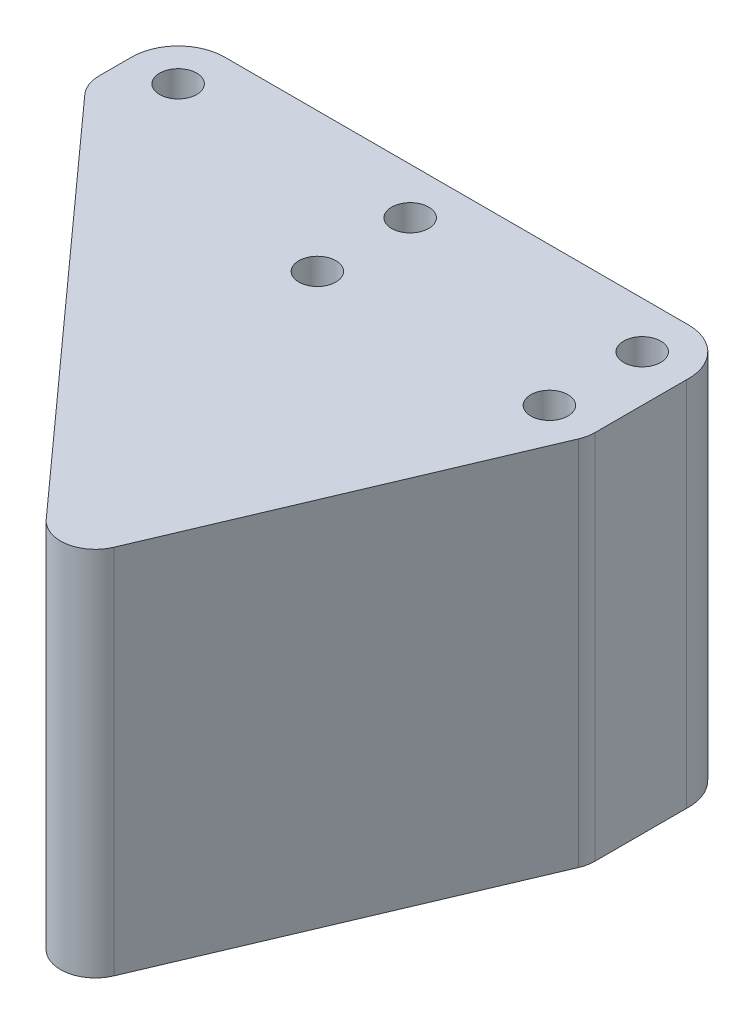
ISO-10303-21;
HEADER;
FILE_DESCRIPTION(('STEP AP214'),'2;1');
FILE_NAME('part.step','',(''),(''),'','','');
FILE_SCHEMA(('AUTOMOTIVE_DESIGN { 1 0 10303 214 1 1 1 1 }'));
ENDSEC;
DATA;
#1=APPLICATION_CONTEXT('core data for automotive mechanical design processes');
#2=APPLICATION_PROTOCOL_DEFINITION('international standard','automotive_design',2000,#1);
#3=PRODUCT_CONTEXT('',#1,'mechanical');
#4=PRODUCT('Part','Part','',(#3));
#5=PRODUCT_RELATED_PRODUCT_CATEGORY('part','',(#4));
#6=PRODUCT_DEFINITION_FORMATION('','',#4);
#7=PRODUCT_DEFINITION_CONTEXT('part definition',#1,'design');
#8=PRODUCT_DEFINITION('design','',#6,#7);
#9=PRODUCT_DEFINITION_SHAPE('','',#8);
#10=(LENGTH_UNIT() NAMED_UNIT(*) SI_UNIT(.MILLI.,.METRE.));
#11=(NAMED_UNIT(*) PLANE_ANGLE_UNIT() SI_UNIT($,.RADIAN.));
#12=(NAMED_UNIT(*) SI_UNIT($,.STERADIAN.) SOLID_ANGLE_UNIT());
#13=UNCERTAINTY_MEASURE_WITH_UNIT(LENGTH_MEASURE(1.E-05),#10,'distance_accuracy_value','');
#14=(GEOMETRIC_REPRESENTATION_CONTEXT(3) GLOBAL_UNCERTAINTY_ASSIGNED_CONTEXT((#13)) GLOBAL_UNIT_ASSIGNED_CONTEXT((#10,
#11,#12)) REPRESENTATION_CONTEXT('',''));
#15=CARTESIAN_POINT('',(0.,0.,0.));
#16=DIRECTION('',(0.,0.,1.));
#17=DIRECTION('',(1.,0.,0.));
#18=AXIS2_PLACEMENT_3D('',#15,#16,#17);
#19=CARTESIAN_POINT('',(-140.,4.,-8.00000000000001));
#20=DIRECTION('',(0.,0.,1.));
#21=DIRECTION('',(1.,0.,0.));
#22=AXIS2_PLACEMENT_3D('',#19,#20,#21);
#23=PLANE('',#22);
#24=DIRECTION('',(0.,-1.,0.));
#25=VECTOR('',#24,1.);
#26=CARTESIAN_POINT('',(-15.,36.,-8.));
#27=LINE('',#26,#25);
#28=CARTESIAN_POINT('',(-15.,36.,-8.));
#29=VERTEX_POINT('',#28);
#30=CARTESIAN_POINT('',(-15.,4.,-8.));
#31=VERTEX_POINT('',#30);
#32=EDGE_CURVE('E144',#29,#31,#27,.T.);
#33=ORIENTED_EDGE('',*,*,#32,.T.);
#34=DIRECTION('',(-1.,0.,0.));
#35=VECTOR('',#34,1.);
#36=CARTESIAN_POINT('',(-140.,4.,-8.00000000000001));
#37=LINE('',#36,#35);
#38=CARTESIAN_POINT('',(-55.,4.,-8.));
#39=VERTEX_POINT('',#38);
#40=EDGE_CURVE('E135',#31,#39,#37,.T.);
#41=ORIENTED_EDGE('',*,*,#40,.T.);
#42=DIRECTION('',(0.,-1.,0.));
#43=VECTOR('',#42,1.);
#44=CARTESIAN_POINT('',(-55.,36.,-8.));
#45=LINE('',#44,#43);
#46=CARTESIAN_POINT('',(-55.,36.,-8.));
#47=VERTEX_POINT('',#46);
#48=EDGE_CURVE('E149',#47,#39,#45,.T.);
#49=ORIENTED_EDGE('',*,*,#48,.F.);
#50=DIRECTION('',(-1.,0.,0.));
#51=VECTOR('',#50,1.);
#52=CARTESIAN_POINT('',(-55.,36.,-8.));
#53=LINE('',#52,#51);
#54=EDGE_CURVE('E202',#29,#47,#53,.T.);
#55=ORIENTED_EDGE('',*,*,#54,.F.);
#56=EDGE_LOOP('',(#33,#41,#49,#55));
#57=FACE_BOUND('',#56,.T.);
#58=ADVANCED_FACE('F41',(#57),#23,.F.);
#59=CARTESIAN_POINT('',(-15.,0.,-4.));
#60=DIRECTION('',(0.,1.,0.));
#61=DIRECTION('',(0.,0.,1.));
#62=AXIS2_PLACEMENT_3D('',#59,#60,#61);
#63=CYLINDRICAL_SURFACE('',#62,1.60000000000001);
#64=CARTESIAN_POINT('',(-15.,4.,-4.));
#65=DIRECTION('',(0.,1.,0.));
#66=DIRECTION('',(0.,0.,1.));
#67=AXIS2_PLACEMENT_3D('',#64,#65,#66);
#68=CIRCLE('',#67,1.60000000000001);
#69=CARTESIAN_POINT('',(-15.,4.,-2.4));
#70=VERTEX_POINT('',#69);
#71=EDGE_CURVE('E299',#70,#70,#68,.F.);
#72=ORIENTED_EDGE('',*,*,#71,.T.);
#73=EDGE_LOOP('',(#72));
#74=FACE_BOUND('',#73,.T.);
#75=CARTESIAN_POINT('',(-15.,36.,-4.));
#76=DIRECTION('',(0.,1.,0.));
#77=DIRECTION('',(0.,0.,1.));
#78=AXIS2_PLACEMENT_3D('',#75,#76,#77);
#79=CIRCLE('',#78,1.60000000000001);
#80=CARTESIAN_POINT('',(-15.,36.,-2.4));
#81=VERTEX_POINT('',#80);
#82=EDGE_CURVE('E292',#81,#81,#79,.T.);
#83=ORIENTED_EDGE('',*,*,#82,.T.);
#84=EDGE_LOOP('',(#83));
#85=FACE_BOUND('',#84,.T.);
#86=ADVANCED_FACE('F236',(#74,#85),#63,.F.);
#87=CARTESIAN_POINT('',(-35.,0.,-3.99999999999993));
#88=DIRECTION('',(0.,1.,0.));
#89=DIRECTION('',(0.,0.,1.));
#90=AXIS2_PLACEMENT_3D('',#87,#88,#89);
#91=CYLINDRICAL_SURFACE('',#90,1.60000000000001);
#92=CARTESIAN_POINT('',(-35.,4.,-3.99999999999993));
#93=DIRECTION('',(0.,1.,0.));
#94=DIRECTION('',(0.,0.,1.));
#95=AXIS2_PLACEMENT_3D('',#92,#93,#94);
#96=CIRCLE('',#95,1.60000000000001);
#97=CARTESIAN_POINT('',(-35.,4.,-2.39999999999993));
#98=VERTEX_POINT('',#97);
#99=EDGE_CURVE('E302',#98,#98,#96,.F.);
#100=ORIENTED_EDGE('',*,*,#99,.T.);
#101=EDGE_LOOP('',(#100));
#102=FACE_BOUND('',#101,.T.);
#103=CARTESIAN_POINT('',(-35.,36.,-3.99999999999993));
#104=DIRECTION('',(0.,1.,0.));
#105=DIRECTION('',(0.,0.,1.));
#106=AXIS2_PLACEMENT_3D('',#103,#104,#105);
#107=CIRCLE('',#106,1.60000000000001);
#108=CARTESIAN_POINT('',(-35.,36.,-2.39999999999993));
#109=VERTEX_POINT('',#108);
#110=EDGE_CURVE('E216',#109,#109,#107,.T.);
#111=ORIENTED_EDGE('',*,*,#110,.T.);
#112=EDGE_LOOP('',(#111));
#113=FACE_BOUND('',#112,.T.);
#114=ADVANCED_FACE('F242',(#102,#113),#91,.F.);
#115=CARTESIAN_POINT('',(-55.,0.,-3.99999999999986));
#116=DIRECTION('',(0.,1.,0.));
#117=DIRECTION('',(0.,0.,1.));
#118=AXIS2_PLACEMENT_3D('',#115,#116,#117);
#119=CYLINDRICAL_SURFACE('',#118,1.59999999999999);
#120=CARTESIAN_POINT('',(-55.,4.,-3.99999999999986));
#121=DIRECTION('',(0.,1.,0.));
#122=DIRECTION('',(0.,0.,1.));
#123=AXIS2_PLACEMENT_3D('',#120,#121,#122);
#124=CIRCLE('',#123,1.59999999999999);
#125=CARTESIAN_POINT('',(-55.,4.,-2.39999999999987));
#126=VERTEX_POINT('',#125);
#127=EDGE_CURVE('E305',#126,#126,#124,.F.);
#128=ORIENTED_EDGE('',*,*,#127,.T.);
#129=EDGE_LOOP('',(#128));
#130=FACE_BOUND('',#129,.T.);
#131=CARTESIAN_POINT('',(-55.,36.,-3.99999999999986));
#132=DIRECTION('',(0.,1.,0.));
#133=DIRECTION('',(0.,0.,1.));
#134=AXIS2_PLACEMENT_3D('',#131,#132,#133);
#135=CIRCLE('',#134,1.59999999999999);
#136=CARTESIAN_POINT('',(-55.,36.,-2.39999999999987));
#137=VERTEX_POINT('',#136);
#138=EDGE_CURVE('E213',#137,#137,#135,.T.);
#139=ORIENTED_EDGE('',*,*,#138,.T.);
#140=EDGE_LOOP('',(#139));
#141=FACE_BOUND('',#140,.T.);
#142=ADVANCED_FACE('F272',(#130,#141),#119,.F.);
#143=CARTESIAN_POINT('',(-35.,0.,4.));
#144=DIRECTION('',(0.,1.,0.));
#145=DIRECTION('',(0.,0.,1.));
#146=AXIS2_PLACEMENT_3D('',#143,#144,#145);
#147=CYLINDRICAL_SURFACE('',#146,1.60000000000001);
#148=CARTESIAN_POINT('',(-35.,4.,4.));
#149=DIRECTION('',(0.,1.,0.));
#150=DIRECTION('',(0.,0.,1.));
#151=AXIS2_PLACEMENT_3D('',#148,#149,#150);
#152=CIRCLE('',#151,1.60000000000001);
#153=CARTESIAN_POINT('',(-35.,4.,5.60000000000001));
#154=VERTEX_POINT('',#153);
#155=EDGE_CURVE('E288',#154,#154,#152,.F.);
#156=ORIENTED_EDGE('',*,*,#155,.T.);
#157=EDGE_LOOP('',(#156));
#158=FACE_BOUND('',#157,.T.);
#159=CARTESIAN_POINT('',(-35.,36.,4.));
#160=DIRECTION('',(0.,1.,0.));
#161=DIRECTION('',(0.,0.,1.));
#162=AXIS2_PLACEMENT_3D('',#159,#160,#161);
#163=CIRCLE('',#162,1.60000000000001);
#164=CARTESIAN_POINT('',(-35.,36.,5.60000000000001));
#165=VERTEX_POINT('',#164);
#166=EDGE_CURVE('E221',#165,#165,#163,.T.);
#167=ORIENTED_EDGE('',*,*,#166,.T.);
#168=EDGE_LOOP('',(#167));
#169=FACE_BOUND('',#168,.T.);
#170=ADVANCED_FACE('F275',(#158,#169),#147,.F.);
#171=CARTESIAN_POINT('',(-14.9999999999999,0.,4.));
#172=DIRECTION('',(0.,1.,0.));
#173=DIRECTION('',(0.,0.,1.));
#174=AXIS2_PLACEMENT_3D('',#171,#172,#173);
#175=CYLINDRICAL_SURFACE('',#174,1.60000000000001);
#176=CARTESIAN_POINT('',(-14.9999999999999,4.,4.));
#177=DIRECTION('',(0.,1.,0.));
#178=DIRECTION('',(0.,0.,1.));
#179=AXIS2_PLACEMENT_3D('',#176,#177,#178);
#180=CIRCLE('',#179,1.60000000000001);
#181=CARTESIAN_POINT('',(-14.9999999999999,4.,5.60000000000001));
#182=VERTEX_POINT('',#181);
#183=EDGE_CURVE('E309',#182,#182,#180,.F.);
#184=ORIENTED_EDGE('',*,*,#183,.T.);
#185=EDGE_LOOP('',(#184));
#186=FACE_BOUND('',#185,.T.);
#187=CARTESIAN_POINT('',(-14.9999999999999,36.,4.));
#188=DIRECTION('',(0.,1.,0.));
#189=DIRECTION('',(0.,0.,1.));
#190=AXIS2_PLACEMENT_3D('',#187,#188,#189);
#191=CIRCLE('',#190,1.60000000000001);
#192=CARTESIAN_POINT('',(-14.9999999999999,36.,5.60000000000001));
#193=VERTEX_POINT('',#192);
#194=EDGE_CURVE('E294',#193,#193,#191,.T.);
#195=ORIENTED_EDGE('',*,*,#194,.T.);
#196=EDGE_LOOP('',(#195));
#197=FACE_BOUND('',#196,.T.);
#198=ADVANCED_FACE('F247',(#186,#197),#175,.F.);
#199=CARTESIAN_POINT('',(-55.,4.,-3.99999999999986));
#200=DIRECTION('',(0.,-1.,0.));
#201=DIRECTION('',(0.,0.,-1.));
#202=AXIS2_PLACEMENT_3D('',#199,#200,#201);
#203=PLANE('',#202);
#204=DIRECTION('',(0.390731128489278,0.,-0.920504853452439));
#205=VECTOR('',#204,1.);
#206=CARTESIAN_POINT('',(-11.0035252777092,4.,4.68045233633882));
#207=LINE('',#206,#205);
#208=CARTESIAN_POINT('',(-23.1798650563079,4.,33.366111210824));
#209=VERTEX_POINT('',#208);
#210=CARTESIAN_POINT('',(-11.2420107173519,4.,5.24228882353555));
#211=VERTEX_POINT('',#210);
#212=EDGE_CURVE('E156',#209,#211,#207,.T.);
#213=ORIENTED_EDGE('',*,*,#212,.F.);
#214=CARTESIAN_POINT('',(-25.9413796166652,4.,32.1939178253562));
#215=DIRECTION('',(0.,-1.,0.));
#216=DIRECTION('',(0.,0.,-1.));
#217=AXIS2_PLACEMENT_3D('',#214,#215,#216);
#218=CIRCLE('',#217,3.);
#219=CARTESIAN_POINT('',(-28.1708140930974,4.,34.2013096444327));
#220=VERTEX_POINT('',#219);
#221=EDGE_CURVE('E163',#209,#220,#218,.T.);
#222=ORIENTED_EDGE('',*,*,#221,.T.);
#223=DIRECTION('',(0.669130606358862,0.,0.743144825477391));
#224=VECTOR('',#223,1.);
#225=CARTESIAN_POINT('',(-25.0198401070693,4.,37.7008207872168));
#226=LINE('',#225,#224);
#227=CARTESIAN_POINT('',(-58.2294344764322,4.,0.817829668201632));
#228=VERTEX_POINT('',#227);
#229=EDGE_CURVE('E147',#228,#220,#226,.T.);
#230=ORIENTED_EDGE('',*,*,#229,.F.);
#231=CARTESIAN_POINT('',(-56.,4.,-1.18956215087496));
#232=DIRECTION('',(0.,-1.,0.));
#233=DIRECTION('',(0.,0.,-1.));
#234=AXIS2_PLACEMENT_3D('',#231,#232,#233);
#235=CIRCLE('',#234,3.);
#236=CARTESIAN_POINT('',(-59.,4.,-1.18956215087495));
#237=VERTEX_POINT('',#236);
#238=EDGE_CURVE('E161',#228,#237,#235,.T.);
#239=ORIENTED_EDGE('',*,*,#238,.T.);
#240=DIRECTION('',(0.,0.,1.));
#241=VECTOR('',#240,1.);
#242=CARTESIAN_POINT('',(-59.,4.,-0.0379700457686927));
#243=LINE('',#242,#241);
#244=CARTESIAN_POINT('',(-59.0000000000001,4.,-3.99999999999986));
#245=VERTEX_POINT('',#244);
#246=EDGE_CURVE('E128',#245,#237,#243,.T.);
#247=ORIENTED_EDGE('',*,*,#246,.F.);
#248=CARTESIAN_POINT('',(-55.,4.,-3.99999999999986));
#249=DIRECTION('',(0.,1.,0.));
#250=DIRECTION('',(0.,0.,-1.));
#251=AXIS2_PLACEMENT_3D('',#248,#249,#250);
#252=CIRCLE('',#251,4.00000000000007);
#253=EDGE_CURVE('E212',#39,#245,#252,.T.);
#254=ORIENTED_EDGE('',*,*,#253,.F.);
#255=ORIENTED_EDGE('',*,*,#40,.F.);
#256=CARTESIAN_POINT('',(-15.,4.,-4.));
#257=DIRECTION('',(0.,1.,0.));
#258=DIRECTION('',(0.,0.,-1.));
#259=AXIS2_PLACEMENT_3D('',#256,#257,#258);
#260=CIRCLE('',#259,4.);
#261=CARTESIAN_POINT('',(-11.0035252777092,4.,-3.83210183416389));
#262=VERTEX_POINT('',#261);
#263=EDGE_CURVE('E127',#262,#31,#260,.T.);
#264=ORIENTED_EDGE('',*,*,#263,.F.);
#265=DIRECTION('',(0.,0.,-1.));
#266=VECTOR('',#265,1.);
#267=CARTESIAN_POINT('',(-11.0035252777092,4.,-3.83210183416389));
#268=LINE('',#267,#266);
#269=CARTESIAN_POINT('',(-11.0035252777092,4.,4.07009543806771));
#270=VERTEX_POINT('',#269);
#271=EDGE_CURVE('E119',#270,#262,#268,.T.);
#272=ORIENTED_EDGE('',*,*,#271,.F.);
#273=CARTESIAN_POINT('',(-14.0035252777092,4.,4.07009543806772));
#274=DIRECTION('',(0.,-1.,0.));
#275=DIRECTION('',(0.,0.,-1.));
#276=AXIS2_PLACEMENT_3D('',#273,#274,#275);
#277=CIRCLE('',#276,3.);
#278=EDGE_CURVE('E159',#270,#211,#277,.T.);
#279=ORIENTED_EDGE('',*,*,#278,.T.);
#280=EDGE_LOOP('',(#213,#222,#230,#239,#247,#254,#255,#264,#272,#279));
#281=FACE_BOUND('',#280,.T.);
#282=ORIENTED_EDGE('',*,*,#99,.F.);
#283=EDGE_LOOP('',(#282));
#284=FACE_BOUND('',#283,.T.);
#285=ORIENTED_EDGE('',*,*,#155,.F.);
#286=EDGE_LOOP('',(#285));
#287=FACE_BOUND('',#286,.T.);
#288=ORIENTED_EDGE('',*,*,#183,.F.);
#289=EDGE_LOOP('',(#288));
#290=FACE_BOUND('',#289,.T.);
#291=ORIENTED_EDGE('',*,*,#127,.F.);
#292=EDGE_LOOP('',(#291));
#293=FACE_BOUND('',#292,.T.);
#294=ORIENTED_EDGE('',*,*,#71,.F.);
#295=EDGE_LOOP('',(#294));
#296=FACE_BOUND('',#295,.T.);
#297=ADVANCED_FACE('F132',(#281,#284,#287,#290,#293,#296),#203,.T.);
#298=CARTESIAN_POINT('',(-55.,36.,-3.99999999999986));
#299=DIRECTION('',(0.,-1.,0.));
#300=DIRECTION('',(0.,0.,-1.));
#301=AXIS2_PLACEMENT_3D('',#298,#299,#300);
#302=PLANE('',#301);
#303=DIRECTION('',(0.669130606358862,0.,0.743144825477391));
#304=VECTOR('',#303,1.);
#305=CARTESIAN_POINT('',(-25.0198401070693,36.,37.7008207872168));
#306=LINE('',#305,#304);
#307=CARTESIAN_POINT('',(-58.2294344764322,36.,0.817829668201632));
#308=VERTEX_POINT('',#307);
#309=CARTESIAN_POINT('',(-28.1708140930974,36.,34.2013096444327));
#310=VERTEX_POINT('',#309);
#311=EDGE_CURVE('E181',#308,#310,#306,.T.);
#312=ORIENTED_EDGE('',*,*,#311,.T.);
#313=CARTESIAN_POINT('',(-25.9413796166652,36.,32.1939178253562));
#314=DIRECTION('',(0.,-1.,0.));
#315=DIRECTION('',(0.,0.,-1.));
#316=AXIS2_PLACEMENT_3D('',#313,#314,#315);
#317=CIRCLE('',#316,3.);
#318=CARTESIAN_POINT('',(-23.1798650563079,36.,33.366111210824));
#319=VERTEX_POINT('',#318);
#320=EDGE_CURVE('E173',#310,#319,#317,.F.);
#321=ORIENTED_EDGE('',*,*,#320,.T.);
#322=DIRECTION('',(0.390731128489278,0.,-0.920504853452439));
#323=VECTOR('',#322,1.);
#324=CARTESIAN_POINT('',(-11.0035252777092,36.,4.68045233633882));
#325=LINE('',#324,#323);
#326=CARTESIAN_POINT('',(-11.2420107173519,36.,5.24228882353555));
#327=VERTEX_POINT('',#326);
#328=EDGE_CURVE('E179',#319,#327,#325,.T.);
#329=ORIENTED_EDGE('',*,*,#328,.T.);
#330=CARTESIAN_POINT('',(-14.0035252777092,36.,4.07009543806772));
#331=DIRECTION('',(0.,-1.,0.));
#332=DIRECTION('',(0.,0.,-1.));
#333=AXIS2_PLACEMENT_3D('',#330,#331,#332);
#334=CIRCLE('',#333,3.);
#335=CARTESIAN_POINT('',(-11.0035252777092,36.,4.07009543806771));
#336=VERTEX_POINT('',#335);
#337=EDGE_CURVE('E56',#327,#336,#334,.F.);
#338=ORIENTED_EDGE('',*,*,#337,.T.);
#339=DIRECTION('',(0.,0.,-1.));
#340=VECTOR('',#339,1.);
#341=CARTESIAN_POINT('',(-11.0035252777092,36.,-3.83210183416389));
#342=LINE('',#341,#340);
#343=CARTESIAN_POINT('',(-11.0035252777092,36.,-3.83210183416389));
#344=VERTEX_POINT('',#343);
#345=EDGE_CURVE('E189',#336,#344,#342,.T.);
#346=ORIENTED_EDGE('',*,*,#345,.T.);
#347=CARTESIAN_POINT('',(-15.,36.,-4.));
#348=DIRECTION('',(0.,1.,0.));
#349=DIRECTION('',(0.,0.,-1.));
#350=AXIS2_PLACEMENT_3D('',#347,#348,#349);
#351=CIRCLE('',#350,4.);
#352=EDGE_CURVE('E142',#344,#29,#351,.T.);
#353=ORIENTED_EDGE('',*,*,#352,.T.);
#354=ORIENTED_EDGE('',*,*,#54,.T.);
#355=CARTESIAN_POINT('',(-55.,36.,-3.99999999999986));
#356=DIRECTION('',(0.,1.,0.));
#357=DIRECTION('',(0.,0.,-1.));
#358=AXIS2_PLACEMENT_3D('',#355,#356,#357);
#359=CIRCLE('',#358,4.00000000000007);
#360=CARTESIAN_POINT('',(-59.,36.,-3.99999999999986));
#361=VERTEX_POINT('',#360);
#362=EDGE_CURVE('E139',#47,#361,#359,.T.);
#363=ORIENTED_EDGE('',*,*,#362,.T.);
#364=DIRECTION('',(0.,0.,1.));
#365=VECTOR('',#364,1.);
#366=CARTESIAN_POINT('',(-59.,36.,-0.0379700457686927));
#367=LINE('',#366,#365);
#368=CARTESIAN_POINT('',(-59.,36.,-1.18956215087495));
#369=VERTEX_POINT('',#368);
#370=EDGE_CURVE('E226',#361,#369,#367,.T.);
#371=ORIENTED_EDGE('',*,*,#370,.T.);
#372=CARTESIAN_POINT('',(-56.,36.,-1.18956215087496));
#373=DIRECTION('',(0.,-1.,0.));
#374=DIRECTION('',(0.,0.,-1.));
#375=AXIS2_PLACEMENT_3D('',#372,#373,#374);
#376=CIRCLE('',#375,3.);
#377=EDGE_CURVE('E171',#369,#308,#376,.F.);
#378=ORIENTED_EDGE('',*,*,#377,.T.);
#379=EDGE_LOOP('',(#312,#321,#329,#338,#346,#353,#354,#363,#371,#378));
#380=FACE_BOUND('',#379,.T.);
#381=ORIENTED_EDGE('',*,*,#138,.F.);
#382=EDGE_LOOP('',(#381));
#383=FACE_BOUND('',#382,.T.);
#384=ORIENTED_EDGE('',*,*,#110,.F.);
#385=EDGE_LOOP('',(#384));
#386=FACE_BOUND('',#385,.T.);
#387=ORIENTED_EDGE('',*,*,#166,.F.);
#388=EDGE_LOOP('',(#387));
#389=FACE_BOUND('',#388,.T.);
#390=ORIENTED_EDGE('',*,*,#82,.F.);
#391=EDGE_LOOP('',(#390));
#392=FACE_BOUND('',#391,.T.);
#393=ORIENTED_EDGE('',*,*,#194,.F.);
#394=EDGE_LOOP('',(#393));
#395=FACE_BOUND('',#394,.T.);
#396=ADVANCED_FACE('F177',(#380,#383,#386,#389,#392,#395),#302,.F.);
#397=CARTESIAN_POINT('',(-55.,36.,-3.99999999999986));
#398=DIRECTION('',(0.,-1.,0.));
#399=DIRECTION('',(0.,0.,-1.));
#400=AXIS2_PLACEMENT_3D('',#397,#398,#399);
#401=CYLINDRICAL_SURFACE('',#400,4.00000000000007);
#402=ORIENTED_EDGE('',*,*,#253,.T.);
#403=DIRECTION('',(0.,-1.,0.));
#404=VECTOR('',#403,1.);
#405=CARTESIAN_POINT('',(-59.,36.,-3.99999999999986));
#406=LINE('',#405,#404);
#407=EDGE_CURVE('E143',#361,#245,#406,.T.);
#408=ORIENTED_EDGE('',*,*,#407,.F.);
#409=ORIENTED_EDGE('',*,*,#362,.F.);
#410=ORIENTED_EDGE('',*,*,#48,.T.);
#411=EDGE_LOOP('',(#402,#408,#409,#410));
#412=FACE_BOUND('',#411,.T.);
#413=ADVANCED_FACE('F270',(#412),#401,.T.);
#414=CARTESIAN_POINT('',(-59.,36.,-0.0379700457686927));
#415=DIRECTION('',(1.,0.,0.));
#416=DIRECTION('',(0.,0.,-1.));
#417=AXIS2_PLACEMENT_3D('',#414,#415,#416);
#418=PLANE('',#417);
#419=ORIENTED_EDGE('',*,*,#246,.T.);
#420=DIRECTION('',(0.,-1.,0.));
#421=VECTOR('',#420,1.);
#422=CARTESIAN_POINT('',(-59.,36.,-1.18956215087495));
#423=LINE('',#422,#421);
#424=EDGE_CURVE('E49',#237,#369,#423,.F.);
#425=ORIENTED_EDGE('',*,*,#424,.T.);
#426=ORIENTED_EDGE('',*,*,#370,.F.);
#427=ORIENTED_EDGE('',*,*,#407,.T.);
#428=EDGE_LOOP('',(#419,#425,#426,#427));
#429=FACE_BOUND('',#428,.T.);
#430=ADVANCED_FACE('F267',(#429),#418,.F.);
#431=CARTESIAN_POINT('',(-25.0198401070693,36.,37.7008207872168));
#432=DIRECTION('',(0.743144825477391,0.,-0.669130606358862));
#433=DIRECTION('',(-0.669130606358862,0.,-0.743144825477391));
#434=AXIS2_PLACEMENT_3D('',#431,#432,#433);
#435=PLANE('',#434);
#436=ORIENTED_EDGE('',*,*,#229,.T.);
#437=DIRECTION('',(0.,-1.,0.));
#438=VECTOR('',#437,1.);
#439=CARTESIAN_POINT('',(-28.1708140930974,36.,34.2013096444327));
#440=LINE('',#439,#438);
#441=EDGE_CURVE('E168',#220,#310,#440,.F.);
#442=ORIENTED_EDGE('',*,*,#441,.T.);
#443=ORIENTED_EDGE('',*,*,#311,.F.);
#444=DIRECTION('',(0.,-1.,0.));
#445=VECTOR('',#444,1.);
#446=CARTESIAN_POINT('',(-58.2294344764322,36.,0.817829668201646));
#447=LINE('',#446,#445);
#448=EDGE_CURVE('E165',#308,#228,#447,.T.);
#449=ORIENTED_EDGE('',*,*,#448,.T.);
#450=EDGE_LOOP('',(#436,#442,#443,#449));
#451=FACE_BOUND('',#450,.T.);
#452=ADVANCED_FACE('F195',(#451),#435,.F.);
#453=CARTESIAN_POINT('',(-11.0035252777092,36.,4.68045233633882));
#454=DIRECTION('',(-0.920504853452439,0.,-0.390731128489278));
#455=DIRECTION('',(-0.390731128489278,0.,0.920504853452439));
#456=AXIS2_PLACEMENT_3D('',#453,#454,#455);
#457=PLANE('',#456);
#458=ORIENTED_EDGE('',*,*,#328,.F.);
#459=DIRECTION('',(0.,-1.,0.));
#460=VECTOR('',#459,1.);
#461=CARTESIAN_POINT('',(-23.1798650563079,36.,33.366111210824));
#462=LINE('',#461,#460);
#463=EDGE_CURVE('E155',#319,#209,#462,.T.);
#464=ORIENTED_EDGE('',*,*,#463,.T.);
#465=ORIENTED_EDGE('',*,*,#212,.T.);
#466=DIRECTION('',(0.,-1.,0.));
#467=VECTOR('',#466,1.);
#468=CARTESIAN_POINT('',(-11.2420107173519,36.,5.24228882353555));
#469=LINE('',#468,#467);
#470=EDGE_CURVE('E153',#211,#327,#469,.F.);
#471=ORIENTED_EDGE('',*,*,#470,.T.);
#472=EDGE_LOOP('',(#458,#464,#465,#471));
#473=FACE_BOUND('',#472,.T.);
#474=ADVANCED_FACE('F186',(#473),#457,.F.);
#475=CARTESIAN_POINT('',(-11.0035252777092,36.,-3.83210183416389));
#476=DIRECTION('',(-1.,0.,0.));
#477=DIRECTION('',(0.,0.,1.));
#478=AXIS2_PLACEMENT_3D('',#475,#476,#477);
#479=PLANE('',#478);
#480=ORIENTED_EDGE('',*,*,#345,.F.);
#481=DIRECTION('',(0.,-1.,0.));
#482=VECTOR('',#481,1.);
#483=CARTESIAN_POINT('',(-11.0035252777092,36.,4.07009543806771));
#484=LINE('',#483,#482);
#485=EDGE_CURVE('E11',#336,#270,#484,.T.);
#486=ORIENTED_EDGE('',*,*,#485,.T.);
#487=ORIENTED_EDGE('',*,*,#271,.T.);
#488=DIRECTION('',(0.,-1.,0.));
#489=VECTOR('',#488,1.);
#490=CARTESIAN_POINT('',(-11.0035252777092,36.,-3.83210183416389));
#491=LINE('',#490,#489);
#492=EDGE_CURVE('E123',#344,#262,#491,.T.);
#493=ORIENTED_EDGE('',*,*,#492,.F.);
#494=EDGE_LOOP('',(#480,#486,#487,#493));
#495=FACE_BOUND('',#494,.T.);
#496=ADVANCED_FACE('F121',(#495),#479,.F.);
#497=CARTESIAN_POINT('',(-15.,36.,-4.));
#498=DIRECTION('',(0.,-1.,0.));
#499=DIRECTION('',(0.,0.,-1.));
#500=AXIS2_PLACEMENT_3D('',#497,#498,#499);
#501=CYLINDRICAL_SURFACE('',#500,4.);
#502=ORIENTED_EDGE('',*,*,#263,.T.);
#503=ORIENTED_EDGE('',*,*,#32,.F.);
#504=ORIENTED_EDGE('',*,*,#352,.F.);
#505=ORIENTED_EDGE('',*,*,#492,.T.);
#506=EDGE_LOOP('',(#502,#503,#504,#505));
#507=FACE_BOUND('',#506,.T.);
#508=ADVANCED_FACE('F141',(#507),#501,.T.);
#509=CARTESIAN_POINT('',(-25.9413796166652,36.,32.1939178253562));
#510=DIRECTION('',(0.,-1.,0.));
#511=DIRECTION('',(0.,0.,-1.));
#512=AXIS2_PLACEMENT_3D('',#509,#510,#511);
#513=CYLINDRICAL_SURFACE('',#512,3.);
#514=ORIENTED_EDGE('',*,*,#320,.F.);
#515=ORIENTED_EDGE('',*,*,#441,.F.);
#516=ORIENTED_EDGE('',*,*,#221,.F.);
#517=ORIENTED_EDGE('',*,*,#463,.F.);
#518=EDGE_LOOP('',(#514,#515,#516,#517));
#519=FACE_BOUND('',#518,.T.);
#520=ADVANCED_FACE('F191',(#519),#513,.T.);
#521=CARTESIAN_POINT('',(-56.,36.,-1.18956215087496));
#522=DIRECTION('',(0.,-1.,0.));
#523=DIRECTION('',(0.,0.,-1.));
#524=AXIS2_PLACEMENT_3D('',#521,#522,#523);
#525=CYLINDRICAL_SURFACE('',#524,3.);
#526=ORIENTED_EDGE('',*,*,#377,.F.);
#527=ORIENTED_EDGE('',*,*,#424,.F.);
#528=ORIENTED_EDGE('',*,*,#238,.F.);
#529=ORIENTED_EDGE('',*,*,#448,.F.);
#530=EDGE_LOOP('',(#526,#527,#528,#529));
#531=FACE_BOUND('',#530,.T.);
#532=ADVANCED_FACE('F230',(#531),#525,.T.);
#533=CARTESIAN_POINT('',(-14.0035252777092,36.,4.07009543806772));
#534=DIRECTION('',(0.,-1.,0.));
#535=DIRECTION('',(0.,0.,-1.));
#536=AXIS2_PLACEMENT_3D('',#533,#534,#535);
#537=CYLINDRICAL_SURFACE('',#536,3.);
#538=ORIENTED_EDGE('',*,*,#337,.F.);
#539=ORIENTED_EDGE('',*,*,#470,.F.);
#540=ORIENTED_EDGE('',*,*,#278,.F.);
#541=ORIENTED_EDGE('',*,*,#485,.F.);
#542=EDGE_LOOP('',(#538,#539,#540,#541));
#543=FACE_BOUND('',#542,.T.);
#544=ADVANCED_FACE('F43',(#543),#537,.T.);
#545=CLOSED_SHELL('',(#58,#86,#114,#142,#170,#198,#297,#396,#413,#430,#452,#474,#496,#508,#520,
#532,#544));
#546=MANIFOLD_SOLID_BREP('B2',#545);
#547=ADVANCED_BREP_SHAPE_REPRESENTATION('',(#18,#546),#14);
#548=SHAPE_DEFINITION_REPRESENTATION(#9,#547);
ENDSEC;
END-ISO-10303-21;
